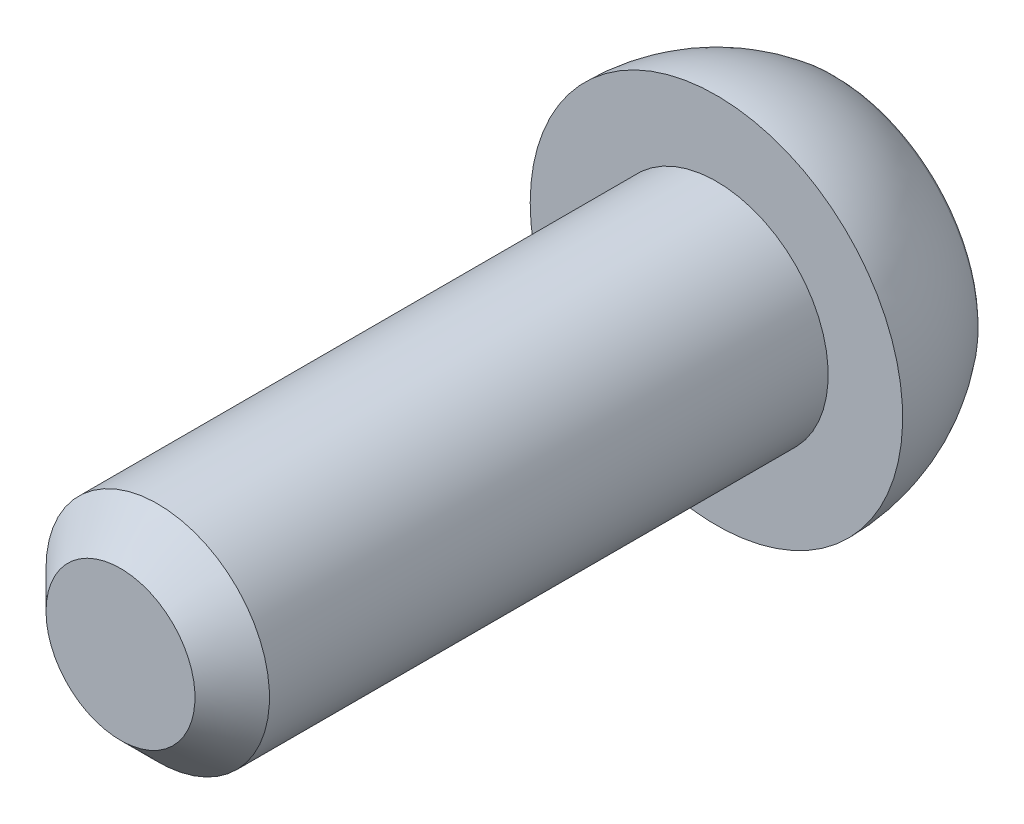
ISO-10303-21;
HEADER;
FILE_DESCRIPTION(('STEP AP214'),'2;1');
FILE_NAME('part.step','',(''),(''),'','','');
FILE_SCHEMA(('AUTOMOTIVE_DESIGN { 1 0 10303 214 1 1 1 1 }'));
ENDSEC;
DATA;
#1=APPLICATION_CONTEXT('core data for automotive mechanical design processes');
#2=APPLICATION_PROTOCOL_DEFINITION('international standard','automotive_design',2000,#1);
#3=PRODUCT_CONTEXT('',#1,'mechanical');
#4=PRODUCT('Part','Part','',(#3));
#5=PRODUCT_RELATED_PRODUCT_CATEGORY('part','',(#4));
#6=PRODUCT_DEFINITION_FORMATION('','',#4);
#7=PRODUCT_DEFINITION_CONTEXT('part definition',#1,'design');
#8=PRODUCT_DEFINITION('design','',#6,#7);
#9=PRODUCT_DEFINITION_SHAPE('','',#8);
#10=(LENGTH_UNIT() NAMED_UNIT(*) SI_UNIT(.MILLI.,.METRE.));
#11=(NAMED_UNIT(*) PLANE_ANGLE_UNIT() SI_UNIT($,.RADIAN.));
#12=(NAMED_UNIT(*) SI_UNIT($,.STERADIAN.) SOLID_ANGLE_UNIT());
#13=UNCERTAINTY_MEASURE_WITH_UNIT(LENGTH_MEASURE(1.E-05),#10,'distance_accuracy_value','');
#14=(GEOMETRIC_REPRESENTATION_CONTEXT(3) GLOBAL_UNCERTAINTY_ASSIGNED_CONTEXT((#13)) GLOBAL_UNIT_ASSIGNED_CONTEXT((#10,
#11,#12)) REPRESENTATION_CONTEXT('',''));
#15=CARTESIAN_POINT('',(0.,0.,0.));
#16=DIRECTION('',(0.,0.,1.));
#17=DIRECTION('',(1.,0.,0.));
#18=AXIS2_PLACEMENT_3D('',#15,#16,#17);
#19=CARTESIAN_POINT('',(-61.38757334,257.949401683,-7.00000000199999));
#20=DIRECTION('',(0.,0.,-0.999999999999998));
#21=DIRECTION('',(0.990350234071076,0.138587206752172,0.));
#22=AXIS2_PLACEMENT_3D('',#19,#20,#21);
#23=PLANE('',#22);
#24=CARTESIAN_POINT('',(-59.1026039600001,256.225433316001,-7.00000000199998));
#25=DIRECTION('',(0.,0.,-0.999999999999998));
#26=DIRECTION('',(-1.,0.,0.));
#27=AXIS2_PLACEMENT_3D('',#24,#25,#26);
#28=CIRCLE('',#27,2.00000000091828);
#29=CARTESIAN_POINT('',(-61.1026039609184,256.225433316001,-7.00000000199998));
#30=VERTEX_POINT('',#29);
#31=EDGE_CURVE('E17',#30,#30,#28,.F.);
#32=ORIENTED_EDGE('',*,*,#31,.T.);
#33=EDGE_LOOP('',(#32));
#34=FACE_BOUND('',#33,.T.);
#35=ADVANCED_FACE('F12',(#34),#23,.F.);
#36=CARTESIAN_POINT('',(-59.1026039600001,256.225433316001,-7.00000000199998));
#37=DIRECTION('',(0.,0.,-0.999999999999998));
#38=DIRECTION('',(-1.,0.,0.));
#39=AXIS2_PLACEMENT_3D('',#36,#37,#38);
#40=CONICAL_SURFACE('',#39,2.00000000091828,0.785398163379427);
#41=CARTESIAN_POINT('',(-59.1026039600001,256.225433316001,-8.000000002));
#42=DIRECTION('',(0.,0.,-0.999999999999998));
#43=DIRECTION('',(0.990350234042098,0.138587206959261,0.));
#44=AXIS2_PLACEMENT_3D('',#41,#42,#43);
#45=CIRCLE('',#44,3.00000000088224);
#46=CARTESIAN_POINT('',(-62.1026039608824,256.225433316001,-8.000000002));
#47=VERTEX_POINT('',#46);
#48=EDGE_CURVE('E95',#47,#47,#45,.F.);
#49=CARTESIAN_POINT('',(-62.1026039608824,256.225433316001,-8.000000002));
#50=CARTESIAN_POINT('',(-62.0921872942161,256.225433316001,-7.98958333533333));
#51=CARTESIAN_POINT('',(-62.0817706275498,256.225433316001,-7.97916666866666));
#52=CARTESIAN_POINT('',(-62.0609372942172,256.225433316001,-7.95833333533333));
#53=CARTESIAN_POINT('',(-62.0505206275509,256.225433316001,-7.94791666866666));
#54=CARTESIAN_POINT('',(-62.0296872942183,256.225433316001,-7.92708333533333));
#55=CARTESIAN_POINT('',(-62.019270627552,256.225433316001,-7.91666666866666));
#56=CARTESIAN_POINT('',(-61.9984372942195,256.225433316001,-7.89583333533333));
#57=CARTESIAN_POINT('',(-61.9880206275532,256.225433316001,-7.88541666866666));
#58=CARTESIAN_POINT('',(-61.9671872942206,256.225433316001,-7.86458333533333));
#59=CARTESIAN_POINT('',(-61.9567706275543,256.225433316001,-7.85416666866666));
#60=CARTESIAN_POINT('',(-61.9359372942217,256.225433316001,-7.83333333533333));
#61=CARTESIAN_POINT('',(-61.9255206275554,256.225433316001,-7.82291666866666));
#62=CARTESIAN_POINT('',(-61.9046872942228,256.225433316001,-7.80208333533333));
#63=CARTESIAN_POINT('',(-61.8942706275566,256.225433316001,-7.79166666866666));
#64=CARTESIAN_POINT('',(-61.873437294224,256.225433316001,-7.77083333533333));
#65=CARTESIAN_POINT('',(-61.8630206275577,256.225433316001,-7.76041666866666));
#66=CARTESIAN_POINT('',(-61.8421872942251,256.225433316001,-7.73958333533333));
#67=CARTESIAN_POINT('',(-61.8317706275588,256.225433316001,-7.72916666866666));
#68=CARTESIAN_POINT('',(-61.8109372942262,256.225433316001,-7.70833333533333));
#69=CARTESIAN_POINT('',(-61.8005206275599,256.225433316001,-7.69791666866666));
#70=CARTESIAN_POINT('',(-61.7796872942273,256.225433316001,-7.67708333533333));
#71=CARTESIAN_POINT('',(-61.7692706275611,256.225433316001,-7.66666666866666));
#72=CARTESIAN_POINT('',(-61.7484372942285,256.225433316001,-7.64583333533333));
#73=CARTESIAN_POINT('',(-61.7380206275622,256.225433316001,-7.63541666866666));
#74=CARTESIAN_POINT('',(-61.7171872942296,256.225433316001,-7.61458333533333));
#75=CARTESIAN_POINT('',(-61.7067706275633,256.225433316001,-7.60416666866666));
#76=CARTESIAN_POINT('',(-61.6859372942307,256.225433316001,-7.58333333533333));
#77=CARTESIAN_POINT('',(-61.6755206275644,256.225433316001,-7.57291666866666));
#78=CARTESIAN_POINT('',(-61.6546872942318,256.225433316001,-7.55208333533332));
#79=CARTESIAN_POINT('',(-61.6442706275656,256.225433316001,-7.54166666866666));
#80=CARTESIAN_POINT('',(-61.623437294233,256.225433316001,-7.52083333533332));
#81=CARTESIAN_POINT('',(-61.6130206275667,256.225433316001,-7.51041666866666));
#82=CARTESIAN_POINT('',(-61.5921872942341,256.225433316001,-7.48958333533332));
#83=CARTESIAN_POINT('',(-61.5817706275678,256.225433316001,-7.47916666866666));
#84=CARTESIAN_POINT('',(-61.5609372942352,256.225433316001,-7.45833333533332));
#85=CARTESIAN_POINT('',(-61.5505206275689,256.225433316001,-7.44791666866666));
#86=CARTESIAN_POINT('',(-61.5296872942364,256.225433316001,-7.42708333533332));
#87=CARTESIAN_POINT('',(-61.5192706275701,256.225433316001,-7.41666666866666));
#88=CARTESIAN_POINT('',(-61.4984372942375,256.225433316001,-7.39583333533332));
#89=CARTESIAN_POINT('',(-61.4880206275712,256.225433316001,-7.38541666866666));
#90=CARTESIAN_POINT('',(-61.4671872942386,256.225433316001,-7.36458333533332));
#91=CARTESIAN_POINT('',(-61.4567706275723,256.225433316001,-7.35416666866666));
#92=CARTESIAN_POINT('',(-61.4359372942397,256.225433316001,-7.33333333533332));
#93=CARTESIAN_POINT('',(-61.4255206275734,256.225433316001,-7.32291666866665));
#94=CARTESIAN_POINT('',(-61.4046872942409,256.225433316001,-7.30208333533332));
#95=CARTESIAN_POINT('',(-61.3942706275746,256.225433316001,-7.29166666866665));
#96=CARTESIAN_POINT('',(-61.373437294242,256.225433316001,-7.27083333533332));
#97=CARTESIAN_POINT('',(-61.3630206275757,256.225433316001,-7.26041666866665));
#98=CARTESIAN_POINT('',(-61.3421872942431,256.225433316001,-7.23958333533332));
#99=CARTESIAN_POINT('',(-61.3317706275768,256.225433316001,-7.22916666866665));
#100=CARTESIAN_POINT('',(-61.3109372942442,256.225433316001,-7.20833333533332));
#101=CARTESIAN_POINT('',(-61.3005206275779,256.225433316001,-7.19791666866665));
#102=CARTESIAN_POINT('',(-61.2796872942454,256.225433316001,-7.17708333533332));
#103=CARTESIAN_POINT('',(-61.2692706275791,256.225433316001,-7.16666666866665));
#104=CARTESIAN_POINT('',(-61.2484372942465,256.225433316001,-7.14583333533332));
#105=CARTESIAN_POINT('',(-61.2380206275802,256.225433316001,-7.13541666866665));
#106=CARTESIAN_POINT('',(-61.2171872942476,256.225433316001,-7.11458333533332));
#107=CARTESIAN_POINT('',(-61.2067706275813,256.225433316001,-7.10416666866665));
#108=CARTESIAN_POINT('',(-61.1859372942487,256.225433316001,-7.08333333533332));
#109=CARTESIAN_POINT('',(-61.1755206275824,256.225433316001,-7.07291666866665));
#110=CARTESIAN_POINT('',(-61.1546872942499,256.225433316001,-7.05208333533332));
#111=CARTESIAN_POINT('',(-61.1442706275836,256.225433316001,-7.04166666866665));
#112=CARTESIAN_POINT('',(-61.123437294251,256.225433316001,-7.02083333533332));
#113=CARTESIAN_POINT('',(-61.1130206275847,256.225433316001,-7.01041666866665));
#114=CARTESIAN_POINT('',(-61.1026039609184,256.225433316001,-7.00000000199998));
#115=B_SPLINE_CURVE_WITH_KNOTS('',3,(#49,#50,#51,#52,#53,#54,#55,#56,#57,#58,#59,#60,#61,#62,
#63,#64,#65,#66,#67,#68,#69,#70,#71,#72,#73,#74,#75,#76,#77,#78,#79,#80,#81,#82,#83,#84,#85,#86,
#87,#88,#89,#90,#91,#92,#93,#94,#95,#96,#97,#98,#99,#100,#101,#102,#103,#104,#105,#106,#107,
#108,#109,#110,#111,#112,#113,#114),.UNSPECIFIED.,.F.,.F.,(4,2,2,2,2,2,2,2,2,2,2,2,2,2,2,2,2,2,
2,2,2,2,2,2,2,2,2,2,2,2,2,2,4),(0.,0.0441941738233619,0.0883883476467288,0.132582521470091,
0.176776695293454,0.220970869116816,0.265165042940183,0.309359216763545,0.353553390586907,
0.397747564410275,0.441941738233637,0.486135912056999,0.530330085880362,0.574524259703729,
0.618718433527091,0.662912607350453,0.707106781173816,0.751300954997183,0.795495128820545,
0.839689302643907,0.883883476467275,0.928077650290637,0.972271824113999,1.01646599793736,
1.06066017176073,1.10485434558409,1.14904851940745,1.19324269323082,1.23743686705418,
1.28163104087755,1.32582521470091,1.37001938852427,1.41421356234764),.UNSPECIFIED.);
#116=EDGE_CURVE('BSEAM262',#47,#30,#115,.T.);
#117=ORIENTED_EDGE('',*,*,#48,.T.);
#118=ORIENTED_EDGE('',*,*,#31,.F.);
#119=ORIENTED_EDGE('',*,*,#116,.T.);
#120=ORIENTED_EDGE('',*,*,#116,.F.);
#121=EDGE_LOOP('',(#117,#119,#118,#120));
#122=FACE_BOUND('',#121,.T.);
#123=ADVANCED_FACE('F262',(#122),#40,.T.);
#124=CARTESIAN_POINT('',(-62.1361919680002,258.189999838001,-24.0000000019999));
#125=DIRECTION('',(0.,0.,-0.999999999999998));
#126=DIRECTION('',(0.99035023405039,0.138587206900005,0.));
#127=AXIS2_PLACEMENT_3D('',#124,#125,#126);
#128=PLANE('',#127);
#129=DIRECTION('',(0.3751550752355,0.926962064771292,0.));
#130=VECTOR('',#129,1.);
#131=CARTESIAN_POINT('',(-61.2958197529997,257.113059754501,-24.0000000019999));
#132=LINE('',#131,#130);
#133=CARTESIAN_POINT('',(-61.8082911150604,255.846806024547,-24.0000000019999));
#134=VERTEX_POINT('',#133);
#135=CARTESIAN_POINT('',(-60.7833483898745,258.379313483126,-24.0000000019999));
#136=VERTEX_POINT('',#135);
#137=EDGE_CURVE('E107',#134,#136,#132,.T.);
#138=ORIENTED_EDGE('',*,*,#137,.T.);
#139=DIRECTION('',(0.990350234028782,0.13858720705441,0.));
#140=VECTOR('',#139,1.);
#141=CARTESIAN_POINT('',(-59.4305048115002,258.568627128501,-24.0000000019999));
#142=LINE('',#141,#140);
#143=CARTESIAN_POINT('',(-58.0776612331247,258.757940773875,-24.0000000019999));
#144=VERTEX_POINT('',#143);
#145=EDGE_CURVE('E86',#136,#144,#142,.T.);
#146=ORIENTED_EDGE('',*,*,#145,.T.);
#147=DIRECTION('',(0.615195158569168,-0.788374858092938,0.));
#148=VECTOR('',#147,1.);
#149=CARTESIAN_POINT('',(-57.2372890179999,257.681000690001,-24.0000000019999));
#150=LINE('',#149,#148);
#151=CARTESIAN_POINT('',(-56.3969168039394,256.604060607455,-24.0000000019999));
#152=VERTEX_POINT('',#151);
#153=EDGE_CURVE('E81',#144,#152,#150,.T.);
#154=ORIENTED_EDGE('',*,*,#153,.T.);
#155=DIRECTION('',(-0.375155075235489,-0.926962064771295,0.));
#156=VECTOR('',#155,1.);
#157=CARTESIAN_POINT('',(-56.9093881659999,255.337806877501,-24.0000000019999));
#158=LINE('',#157,#156);
#159=CARTESIAN_POINT('',(-57.4218595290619,254.071553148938,-24.0000000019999));
#160=VERTEX_POINT('',#159);
#161=EDGE_CURVE('E84',#152,#160,#158,.T.);
#162=ORIENTED_EDGE('',*,*,#161,.T.);
#163=DIRECTION('',(-0.990350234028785,-0.13858720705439,0.));
#164=VECTOR('',#163,1.);
#165=CARTESIAN_POINT('',(-58.7747031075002,253.882239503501,-24.0000000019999));
#166=LINE('',#165,#164);
#167=CARTESIAN_POINT('',(-60.1275466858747,253.692925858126,-24.0000000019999));
#168=VERTEX_POINT('',#167);
#169=EDGE_CURVE('E67',#160,#168,#166,.T.);
#170=ORIENTED_EDGE('',*,*,#169,.T.);
#171=DIRECTION('',(-0.615195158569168,0.788374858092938,0.));
#172=VECTOR('',#171,1.);
#173=CARTESIAN_POINT('',(-60.9679189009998,254.769865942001,-24.0000000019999));
#174=LINE('',#173,#172);
#175=EDGE_CURVE('E114',#168,#134,#174,.T.);
#176=ORIENTED_EDGE('',*,*,#175,.T.);
#177=EDGE_LOOP('',(#138,#146,#154,#162,#170,#176));
#178=FACE_BOUND('',#177,.T.);
#179=ADVANCED_FACE('F83',(#178),#128,.T.);
#180=CARTESIAN_POINT('',(-59.1026039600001,256.225433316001,-8.000000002));
#181=DIRECTION('',(0.,0.,-0.999999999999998));
#182=DIRECTION('',(-1.,0.,0.));
#183=AXIS2_PLACEMENT_3D('',#180,#181,#182);
#184=CYLINDRICAL_SURFACE('',#183,3.00000000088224);
#185=CARTESIAN_POINT('',(-59.1026039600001,256.225433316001,-23.000000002));
#186=DIRECTION('',(0.,0.,-0.999999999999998));
#187=DIRECTION('',(-1.,0.,0.));
#188=AXIS2_PLACEMENT_3D('',#185,#186,#187);
#189=CIRCLE('',#188,3.00000000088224);
#190=CARTESIAN_POINT('',(-62.1026039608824,256.225433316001,-23.000000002));
#191=VERTEX_POINT('',#190);
#192=EDGE_CURVE('E127',#191,#191,#189,.F.);
#193=CARTESIAN_POINT('',(-62.1026039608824,256.225433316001,-23.000000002));
#194=CARTESIAN_POINT('',(-62.1026039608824,256.225433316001,-22.843750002));
#195=CARTESIAN_POINT('',(-62.1026039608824,256.225433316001,-22.687500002));
#196=CARTESIAN_POINT('',(-62.1026039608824,256.225433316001,-22.375000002));
#197=CARTESIAN_POINT('',(-62.1026039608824,256.225433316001,-22.218750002));
#198=CARTESIAN_POINT('',(-62.1026039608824,256.225433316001,-21.906250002));
#199=CARTESIAN_POINT('',(-62.1026039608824,256.225433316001,-21.750000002));
#200=CARTESIAN_POINT('',(-62.1026039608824,256.225433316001,-21.437500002));
#201=CARTESIAN_POINT('',(-62.1026039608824,256.225433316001,-21.281250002));
#202=CARTESIAN_POINT('',(-62.1026039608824,256.225433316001,-20.968750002));
#203=CARTESIAN_POINT('',(-62.1026039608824,256.225433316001,-20.812500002));
#204=CARTESIAN_POINT('',(-62.1026039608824,256.225433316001,-20.500000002));
#205=CARTESIAN_POINT('',(-62.1026039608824,256.225433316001,-20.343750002));
#206=CARTESIAN_POINT('',(-62.1026039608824,256.225433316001,-20.031250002));
#207=CARTESIAN_POINT('',(-62.1026039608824,256.225433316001,-19.875000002));
#208=CARTESIAN_POINT('',(-62.1026039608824,256.225433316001,-19.562500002));
#209=CARTESIAN_POINT('',(-62.1026039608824,256.225433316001,-19.406250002));
#210=CARTESIAN_POINT('',(-62.1026039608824,256.225433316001,-19.093750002));
#211=CARTESIAN_POINT('',(-62.1026039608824,256.225433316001,-18.937500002));
#212=CARTESIAN_POINT('',(-62.1026039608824,256.225433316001,-18.625000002));
#213=CARTESIAN_POINT('',(-62.1026039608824,256.225433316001,-18.468750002));
#214=CARTESIAN_POINT('',(-62.1026039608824,256.225433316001,-18.156250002));
#215=CARTESIAN_POINT('',(-62.1026039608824,256.225433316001,-18.000000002));
#216=CARTESIAN_POINT('',(-62.1026039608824,256.225433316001,-17.687500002));
#217=CARTESIAN_POINT('',(-62.1026039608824,256.225433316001,-17.531250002));
#218=CARTESIAN_POINT('',(-62.1026039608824,256.225433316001,-17.218750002));
#219=CARTESIAN_POINT('',(-62.1026039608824,256.225433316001,-17.062500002));
#220=CARTESIAN_POINT('',(-62.1026039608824,256.225433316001,-16.750000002));
#221=CARTESIAN_POINT('',(-62.1026039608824,256.225433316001,-16.593750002));
#222=CARTESIAN_POINT('',(-62.1026039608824,256.225433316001,-16.281250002));
#223=CARTESIAN_POINT('',(-62.1026039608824,256.225433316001,-16.125000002));
#224=CARTESIAN_POINT('',(-62.1026039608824,256.225433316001,-15.812500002));
#225=CARTESIAN_POINT('',(-62.1026039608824,256.225433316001,-15.656250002));
#226=CARTESIAN_POINT('',(-62.1026039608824,256.225433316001,-15.343750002));
#227=CARTESIAN_POINT('',(-62.1026039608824,256.225433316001,-15.187500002));
#228=CARTESIAN_POINT('',(-62.1026039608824,256.225433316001,-14.875000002));
#229=CARTESIAN_POINT('',(-62.1026039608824,256.225433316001,-14.718750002));
#230=CARTESIAN_POINT('',(-62.1026039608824,256.225433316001,-14.406250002));
#231=CARTESIAN_POINT('',(-62.1026039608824,256.225433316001,-14.250000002));
#232=CARTESIAN_POINT('',(-62.1026039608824,256.225433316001,-13.937500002));
#233=CARTESIAN_POINT('',(-62.1026039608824,256.225433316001,-13.781250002));
#234=CARTESIAN_POINT('',(-62.1026039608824,256.225433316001,-13.468750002));
#235=CARTESIAN_POINT('',(-62.1026039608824,256.225433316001,-13.312500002));
#236=CARTESIAN_POINT('',(-62.1026039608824,256.225433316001,-13.000000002));
#237=CARTESIAN_POINT('',(-62.1026039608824,256.225433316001,-12.843750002));
#238=CARTESIAN_POINT('',(-62.1026039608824,256.225433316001,-12.531250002));
#239=CARTESIAN_POINT('',(-62.1026039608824,256.225433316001,-12.375000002));
#240=CARTESIAN_POINT('',(-62.1026039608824,256.225433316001,-12.062500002));
#241=CARTESIAN_POINT('',(-62.1026039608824,256.225433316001,-11.906250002));
#242=CARTESIAN_POINT('',(-62.1026039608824,256.225433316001,-11.593750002));
#243=CARTESIAN_POINT('',(-62.1026039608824,256.225433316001,-11.437500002));
#244=CARTESIAN_POINT('',(-62.1026039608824,256.225433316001,-11.125000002));
#245=CARTESIAN_POINT('',(-62.1026039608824,256.225433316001,-10.968750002));
#246=CARTESIAN_POINT('',(-62.1026039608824,256.225433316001,-10.656250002));
#247=CARTESIAN_POINT('',(-62.1026039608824,256.225433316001,-10.500000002));
#248=CARTESIAN_POINT('',(-62.1026039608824,256.225433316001,-10.187500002));
#249=CARTESIAN_POINT('',(-62.1026039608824,256.225433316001,-10.031250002));
#250=CARTESIAN_POINT('',(-62.1026039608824,256.225433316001,-9.71875000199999));
#251=CARTESIAN_POINT('',(-62.1026039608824,256.225433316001,-9.56250000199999));
#252=CARTESIAN_POINT('',(-62.1026039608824,256.225433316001,-9.25000000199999));
#253=CARTESIAN_POINT('',(-62.1026039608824,256.225433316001,-9.09375000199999));
#254=CARTESIAN_POINT('',(-62.1026039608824,256.225433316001,-8.781250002));
#255=CARTESIAN_POINT('',(-62.1026039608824,256.225433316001,-8.625000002));
#256=CARTESIAN_POINT('',(-62.1026039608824,256.225433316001,-8.312500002));
#257=CARTESIAN_POINT('',(-62.1026039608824,256.225433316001,-8.156250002));
#258=CARTESIAN_POINT('',(-62.1026039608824,256.225433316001,-8.000000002));
#259=B_SPLINE_CURVE_WITH_KNOTS('',3,(#193,#194,#195,#196,#197,#198,#199,#200,#201,#202,#203,
#204,#205,#206,#207,#208,#209,#210,#211,#212,#213,#214,#215,#216,#217,#218,#219,#220,#221,#222,
#223,#224,#225,#226,#227,#228,#229,#230,#231,#232,#233,#234,#235,#236,#237,#238,#239,#240,#241,
#242,#243,#244,#245,#246,#247,#248,#249,#250,#251,#252,#253,#254,#255,#256,#257,#258),
.UNSPECIFIED.,.F.,.F.,(4,2,2,2,2,2,2,2,2,2,2,2,2,2,2,2,2,2,2,2,2,2,2,2,2,2,2,2,2,2,2,2,4),(0.,
0.46875,0.937499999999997,1.40624999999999,1.87499999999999,2.34375,2.81249999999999,
3.28124999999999,3.74999999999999,4.21874999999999,4.68749999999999,5.15624999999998,
5.62499999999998,6.09374999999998,6.56249999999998,7.03124999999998,7.49999999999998,
7.96874999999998,8.43749999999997,8.90624999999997,9.37499999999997,9.84374999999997,10.3125,
10.78125,11.25,11.71875,12.1875,12.65625,13.125,13.59375,14.0625,14.53125,15.),.UNSPECIFIED.);
#260=EDGE_CURVE('BSEAM260',#191,#47,#259,.T.);
#261=ORIENTED_EDGE('',*,*,#192,.T.);
#262=ORIENTED_EDGE('',*,*,#48,.F.);
#263=ORIENTED_EDGE('',*,*,#260,.T.);
#264=ORIENTED_EDGE('',*,*,#260,.F.);
#265=EDGE_LOOP('',(#261,#263,#262,#264));
#266=FACE_BOUND('',#265,.T.);
#267=ADVANCED_FACE('F260',(#266),#184,.T.);
#268=CARTESIAN_POINT('',(-57.4218595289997,254.071553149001,-26.3000000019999));
#269=DIRECTION('',(0.926962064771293,-0.375155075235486,0.));
#270=DIRECTION('',(0.375155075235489,0.926962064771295,0.));
#271=AXIS2_PLACEMENT_3D('',#268,#269,#270);
#272=PLANE('',#271);
#273=DIRECTION('',(0.,0.,0.999999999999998));
#274=VECTOR('',#273,1.);
#275=CARTESIAN_POINT('',(-57.4218595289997,254.071553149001,-25.1500000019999));
#276=LINE('',#275,#274);
#277=CARTESIAN_POINT('',(-57.4218595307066,254.071553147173,-26.3000000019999));
#278=VERTEX_POINT('',#277);
#279=EDGE_CURVE('E94',#278,#160,#276,.T.);
#280=ORIENTED_EDGE('',*,*,#279,.T.);
#281=ORIENTED_EDGE('',*,*,#161,.F.);
#282=DIRECTION('',(0.,0.,-0.999999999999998));
#283=VECTOR('',#282,1.);
#284=CARTESIAN_POINT('',(-56.396916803,256.604060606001,-25.1500000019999));
#285=LINE('',#284,#283);
#286=CARTESIAN_POINT('',(-56.3969168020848,256.604060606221,-26.3000000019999));
#287=VERTEX_POINT('',#286);
#288=EDGE_CURVE('E90',#152,#287,#285,.T.);
#289=ORIENTED_EDGE('',*,*,#288,.T.);
#290=DIRECTION('',(0.37515507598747,0.926962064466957,0.));
#291=VECTOR('',#290,1.);
#292=CARTESIAN_POINT('',(-57.4218595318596,254.07155314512,-26.3000000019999));
#293=LINE('',#292,#291);
#294=EDGE_CURVE('E58',#278,#287,#293,.T.);
#295=ORIENTED_EDGE('',*,*,#294,.F.);
#296=EDGE_LOOP('',(#280,#281,#289,#295));
#297=FACE_BOUND('',#296,.T.);
#298=ADVANCED_FACE('F92',(#297),#272,.F.);
#299=CARTESIAN_POINT('',(-56.396916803,256.604060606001,-26.3000000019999));
#300=DIRECTION('',(0.788374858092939,0.615195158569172,0.));
#301=DIRECTION('',(-0.615195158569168,0.788374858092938,0.));
#302=AXIS2_PLACEMENT_3D('',#299,#300,#301);
#303=PLANE('',#302);
#304=ORIENTED_EDGE('',*,*,#288,.F.);
#305=ORIENTED_EDGE('',*,*,#153,.F.);
#306=DIRECTION('',(0.,0.,-0.999999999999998));
#307=VECTOR('',#306,1.);
#308=CARTESIAN_POINT('',(-58.0776612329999,258.757940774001,-25.1500000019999));
#309=LINE('',#308,#307);
#310=CARTESIAN_POINT('',(-58.077661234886,258.757940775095,-26.3000000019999));
#311=VERTEX_POINT('',#310);
#312=EDGE_CURVE('E101',#144,#311,#309,.T.);
#313=ORIENTED_EDGE('',*,*,#312,.T.);
#314=DIRECTION('',(-0.615195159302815,0.788374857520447,0.));
#315=VECTOR('',#314,1.);
#316=CARTESIAN_POINT('',(-56.3969168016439,256.604060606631,-26.3000000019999));
#317=LINE('',#316,#315);
#318=EDGE_CURVE('E99',#287,#311,#317,.T.);
#319=ORIENTED_EDGE('',*,*,#318,.F.);
#320=EDGE_LOOP('',(#304,#305,#313,#319));
#321=FACE_BOUND('',#320,.T.);
#322=ADVANCED_FACE('F97',(#321),#303,.F.);
#323=CARTESIAN_POINT('',(-58.0776612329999,258.757940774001,-24.0000000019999));
#324=DIRECTION('',(-0.138587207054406,0.990350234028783,0.));
#325=DIRECTION('',(0.,0.,-0.999999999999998));
#326=AXIS2_PLACEMENT_3D('',#323,#324,#325);
#327=PLANE('',#326);
#328=ORIENTED_EDGE('',*,*,#312,.F.);
#329=ORIENTED_EDGE('',*,*,#145,.F.);
#330=DIRECTION('',(0.,0.,-0.999999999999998));
#331=VECTOR('',#330,1.);
#332=CARTESIAN_POINT('',(-60.7833483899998,258.379313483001,-25.1500000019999));
#333=LINE('',#332,#331);
#334=CARTESIAN_POINT('',(-60.7833483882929,258.379313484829,-26.3000000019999));
#335=VERTEX_POINT('',#334);
#336=EDGE_CURVE('E112',#136,#335,#333,.T.);
#337=ORIENTED_EDGE('',*,*,#336,.T.);
#338=DIRECTION('',(-0.990350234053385,-0.138587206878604,0.));
#339=VECTOR('',#338,1.);
#340=CARTESIAN_POINT('',(-59.4305048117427,258.568627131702,-26.3000000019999));
#341=LINE('',#340,#339);
#342=EDGE_CURVE('E108',#311,#335,#341,.T.);
#343=ORIENTED_EDGE('',*,*,#342,.F.);
#344=EDGE_LOOP('',(#328,#329,#337,#343));
#345=FACE_BOUND('',#344,.T.);
#346=ADVANCED_FACE('F252',(#345),#327,.F.);
#347=CARTESIAN_POINT('',(-60.7833483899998,258.379313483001,-26.3000000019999));
#348=DIRECTION('',(-0.926962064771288,0.375155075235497,0.));
#349=DIRECTION('',(-0.3751550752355,-0.926962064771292,0.));
#350=AXIS2_PLACEMENT_3D('',#347,#348,#349);
#351=PLANE('',#350);
#352=ORIENTED_EDGE('',*,*,#336,.F.);
#353=ORIENTED_EDGE('',*,*,#137,.F.);
#354=DIRECTION('',(0.,0.,-0.999999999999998));
#355=VECTOR('',#354,1.);
#356=CARTESIAN_POINT('',(-61.8082911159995,255.846806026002,-25.1500000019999));
#357=LINE('',#356,#355);
#358=CARTESIAN_POINT('',(-61.8082911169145,255.846806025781,-26.3000000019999));
#359=VERTEX_POINT('',#358);
#360=EDGE_CURVE('E181',#134,#359,#357,.T.);
#361=ORIENTED_EDGE('',*,*,#360,.T.);
#362=DIRECTION('',(-0.375155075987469,-0.926962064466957,0.));
#363=VECTOR('',#362,1.);
#364=CARTESIAN_POINT('',(-60.7833483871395,258.379313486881,-26.3000000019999));
#365=LINE('',#364,#363);
#366=EDGE_CURVE('E111',#335,#359,#365,.T.);
#367=ORIENTED_EDGE('',*,*,#366,.F.);
#368=EDGE_LOOP('',(#352,#353,#361,#367));
#369=FACE_BOUND('',#368,.T.);
#370=ADVANCED_FACE('F246',(#369),#351,.F.);
#371=CARTESIAN_POINT('',(-61.8082911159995,255.846806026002,-26.3000000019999));
#372=DIRECTION('',(-0.788374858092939,-0.615195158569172,0.));
#373=DIRECTION('',(0.615195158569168,-0.788374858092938,0.));
#374=AXIS2_PLACEMENT_3D('',#371,#372,#373);
#375=PLANE('',#374);
#376=ORIENTED_EDGE('',*,*,#360,.F.);
#377=ORIENTED_EDGE('',*,*,#175,.F.);
#378=DIRECTION('',(0.,0.,-0.999999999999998));
#379=VECTOR('',#378,1.);
#380=CARTESIAN_POINT('',(-60.1275466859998,253.692925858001,-25.1500000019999));
#381=LINE('',#380,#379);
#382=CARTESIAN_POINT('',(-60.1275466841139,253.692925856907,-26.3000000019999));
#383=VERTEX_POINT('',#382);
#384=EDGE_CURVE('E139',#168,#383,#381,.T.);
#385=ORIENTED_EDGE('',*,*,#384,.T.);
#386=DIRECTION('',(0.615195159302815,-0.788374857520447,0.));
#387=VECTOR('',#386,1.);
#388=CARTESIAN_POINT('',(-61.8082911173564,255.84680602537,-26.3000000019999));
#389=LINE('',#388,#387);
#390=EDGE_CURVE('E119',#359,#383,#389,.T.);
#391=ORIENTED_EDGE('',*,*,#390,.F.);
#392=EDGE_LOOP('',(#376,#377,#385,#391));
#393=FACE_BOUND('',#392,.T.);
#394=ADVANCED_FACE('F242',(#393),#375,.F.);
#395=CARTESIAN_POINT('',(-57.4218595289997,254.071553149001,-26.3000000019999));
#396=DIRECTION('',(0.138587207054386,-0.990350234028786,0.));
#397=DIRECTION('',(0.,0.,0.999999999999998));
#398=AXIS2_PLACEMENT_3D('',#395,#396,#397);
#399=PLANE('',#398);
#400=ORIENTED_EDGE('',*,*,#384,.F.);
#401=ORIENTED_EDGE('',*,*,#169,.F.);
#402=ORIENTED_EDGE('',*,*,#279,.F.);
#403=DIRECTION('',(0.990350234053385,0.138587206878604,0.));
#404=VECTOR('',#403,1.);
#405=CARTESIAN_POINT('',(-58.7747031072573,253.8822395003,-26.3000000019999));
#406=LINE('',#405,#404);
#407=EDGE_CURVE('E122',#383,#278,#406,.T.);
#408=ORIENTED_EDGE('',*,*,#407,.F.);
#409=EDGE_LOOP('',(#400,#401,#402,#408));
#410=FACE_BOUND('',#409,.T.);
#411=ADVANCED_FACE('F194',(#410),#399,.F.);
#412=CARTESIAN_POINT('',(-59.5908166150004,259.714222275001,-26.300000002));
#413=CARTESIAN_POINT('',(-52.6132386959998,260.690647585,-26.300000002));
#414=CARTESIAN_POINT('',(-51.6368133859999,253.713069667,-26.300000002));
#415=CARTESIAN_POINT('',(-58.614391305,252.736644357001,-26.3000000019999));
#416=CARTESIAN_POINT('',(-59.612318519,259.867875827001,-26.3000000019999));
#417=CARTESIAN_POINT('',(-52.3274334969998,260.887304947,-26.3000000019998));
#418=CARTESIAN_POINT('',(-51.3080043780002,253.602419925,-26.3000000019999));
#419=CARTESIAN_POINT('',(-58.5928894,252.582990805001,-26.3000000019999));
#420=CARTESIAN_POINT('',(-59.6316835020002,260.006258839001,-26.2325694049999));
#421=CARTESIAN_POINT('',(-52.0700324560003,261.064417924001,-26.2325694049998));
#422=CARTESIAN_POINT('',(-51.0118733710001,253.502766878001,-26.2325694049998));
#423=CARTESIAN_POINT('',(-58.5735244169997,252.444607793,-26.2325694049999));
#424=CARTESIAN_POINT('',(-59.645062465,260.101865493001,-26.111111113));
#425=CARTESIAN_POINT('',(-51.8921981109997,261.186782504,-26.111111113));
#426=CARTESIAN_POINT('',(-50.8072811,253.433918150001,-26.111111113));
#427=CARTESIAN_POINT('',(-58.5601454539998,252.349001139,-26.1111111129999));
#428=(BOUNDED_SURFACE() B_SPLINE_SURFACE(3,3,((#412,#413,#414,#415),(#416,#417,#418,#419),(#420,
#421,#422,#423),(#424,#425,#426,#427)),.UNSPECIFIED.,.F.,.F.,
.F.) B_SPLINE_SURFACE_WITH_KNOTS((4,4),(4,4),(0.,1.),(0.,1.),
.UNSPECIFIED.) GEOMETRIC_REPRESENTATION_ITEM() RATIONAL_B_SPLINE_SURFACE(((1.,0.333333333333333,
0.333333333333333,1.),(0.933744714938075,0.311248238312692,0.311248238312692,0.933744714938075),
(0.933744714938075,0.311248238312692,0.311248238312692,0.933744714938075),(1.,0.333333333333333,
0.333333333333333,1.))) REPRESENTATION_ITEM('') SURFACE());
#429=CARTESIAN_POINT('',(-58.614391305,252.736644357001,-26.3000000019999));
#430=CARTESIAN_POINT('',(-58.5928894,252.582990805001,-26.3000000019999));
#431=CARTESIAN_POINT('',(-58.5735244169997,252.444607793,-26.2325694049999));
#432=CARTESIAN_POINT('',(-58.5601454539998,252.349001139,-26.1111111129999));
#433=(BOUNDED_CURVE() B_SPLINE_CURVE(3,(#429,#430,#431,#432),.UNSPECIFIED.,.F.,
.F.) B_SPLINE_CURVE_WITH_KNOTS((4,4),(0.,1.),
.UNSPECIFIED.) CURVE() GEOMETRIC_REPRESENTATION_ITEM() RATIONAL_B_SPLINE_CURVE((1.,
0.933744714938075,0.933744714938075,1.)) REPRESENTATION_ITEM(''));
#434=CARTESIAN_POINT('',(-58.5601454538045,252.349001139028,-26.1111111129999));
#435=VERTEX_POINT('',#434);
#436=CARTESIAN_POINT('',(-58.614391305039,252.736644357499,-26.3000000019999));
#437=VERTEX_POINT('',#436);
#438=EDGE_CURVE('E129',#435,#437,#433,.F.);
#439=CARTESIAN_POINT('',(-58.614391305,252.736644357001,-26.3000000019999));
#440=CARTESIAN_POINT('',(-51.6368133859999,253.713069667,-26.300000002));
#441=CARTESIAN_POINT('',(-52.6132386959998,260.690647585,-26.300000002));
#442=CARTESIAN_POINT('',(-59.5908166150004,259.714222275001,-26.300000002));
#443=(BOUNDED_CURVE() B_SPLINE_CURVE(3,(#439,#440,#441,#442),.UNSPECIFIED.,.F.,
.F.) B_SPLINE_CURVE_WITH_KNOTS((4,4),(0.,1.),
.UNSPECIFIED.) CURVE() GEOMETRIC_REPRESENTATION_ITEM() RATIONAL_B_SPLINE_CURVE((1.,
0.333333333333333,0.333333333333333,1.)) REPRESENTATION_ITEM(''));
#444=CARTESIAN_POINT('',(-59.5908166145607,259.714222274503,-26.300000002));
#445=VERTEX_POINT('',#444);
#446=EDGE_CURVE('E126',#445,#437,#443,.F.);
#447=CARTESIAN_POINT('',(-59.5908166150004,259.714222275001,-26.300000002));
#448=CARTESIAN_POINT('',(-59.612318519,259.867875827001,-26.3000000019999));
#449=CARTESIAN_POINT('',(-59.6316835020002,260.006258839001,-26.2325694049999));
#450=CARTESIAN_POINT('',(-59.645062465,260.101865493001,-26.111111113));
#451=(BOUNDED_CURVE() B_SPLINE_CURVE(3,(#447,#448,#449,#450),.UNSPECIFIED.,.F.,
.F.) B_SPLINE_CURVE_WITH_KNOTS((4,4),(0.,1.),
.UNSPECIFIED.) CURVE() GEOMETRIC_REPRESENTATION_ITEM() RATIONAL_B_SPLINE_CURVE((1.,
0.933744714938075,0.933744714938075,1.)) REPRESENTATION_ITEM(''));
#452=CARTESIAN_POINT('',(-59.6450624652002,260.101865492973,-26.111111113));
#453=VERTEX_POINT('',#452);
#454=EDGE_CURVE('E133',#445,#453,#451,.T.);
#455=CARTESIAN_POINT('',(-59.1026039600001,256.225433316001,-26.1111110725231));
#456=DIRECTION('',(0.,0.,-0.999999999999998));
#457=DIRECTION('',(-0.990350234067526,-0.138587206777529,0.));
#458=AXIS2_PLACEMENT_3D('',#455,#456,#457);
#459=CIRCLE('',#458,3.91420335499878);
#460=EDGE_CURVE('E118',#453,#435,#459,.T.);
#461=ORIENTED_EDGE('',*,*,#438,.T.);
#462=ORIENTED_EDGE('',*,*,#446,.F.);
#463=ORIENTED_EDGE('',*,*,#454,.T.);
#464=ORIENTED_EDGE('',*,*,#460,.T.);
#465=EDGE_LOOP('',(#461,#462,#463,#464));
#466=FACE_BOUND('',#465,.T.);
#467=ADVANCED_FACE('F208',(#466),#428,.T.);
#468=CARTESIAN_POINT('',(-64.8150274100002,260.535354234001,-23.000000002));
#469=DIRECTION('',(0.,0.,-0.999999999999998));
#470=DIRECTION('',(0.9903502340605,0.138587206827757,0.));
#471=AXIS2_PLACEMENT_3D('',#468,#469,#470);
#472=PLANE('',#471);
#473=ORIENTED_EDGE('',*,*,#192,.F.);
#474=EDGE_LOOP('',(#473));
#475=FACE_BOUND('',#474,.T.);
#476=CARTESIAN_POINT('',(-59.1026039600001,256.225433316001,-23.000000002));
#477=DIRECTION('',(0.,0.,-0.999999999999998));
#478=DIRECTION('',(-1.,0.,0.));
#479=AXIS2_PLACEMENT_3D('',#476,#477,#478);
#480=CIRCLE('',#479,4.99999999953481);
#481=CARTESIAN_POINT('',(-64.1026039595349,256.225433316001,-23.000000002));
#482=VERTEX_POINT('',#481);
#483=EDGE_CURVE('E115',#482,#482,#480,.F.);
#484=ORIENTED_EDGE('',*,*,#483,.T.);
#485=EDGE_LOOP('',(#484));
#486=FACE_BOUND('',#485,.T.);
#487=ADVANCED_FACE('F236',(#475,#486),#472,.F.);
#488=CARTESIAN_POINT('',(-56.0660207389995,260.250158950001,-26.300000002));
#489=DIRECTION('',(0.,0.,-0.999999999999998));
#490=DIRECTION('',(0.13858720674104,-0.990350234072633,0.));
#491=AXIS2_PLACEMENT_3D('',#488,#489,#490);
#492=PLANE('',#491);
#493=ORIENTED_EDGE('',*,*,#390,.T.);
#494=ORIENTED_EDGE('',*,*,#407,.T.);
#495=ORIENTED_EDGE('',*,*,#294,.T.);
#496=ORIENTED_EDGE('',*,*,#318,.T.);
#497=ORIENTED_EDGE('',*,*,#342,.T.);
#498=ORIENTED_EDGE('',*,*,#366,.T.);
#499=EDGE_LOOP('',(#493,#494,#495,#496,#497,#498));
#500=FACE_BOUND('',#499,.T.);
#501=CARTESIAN_POINT('',(-59.5908166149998,259.714222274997,-26.300000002));
#502=CARTESIAN_POINT('',(-59.6277319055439,259.709056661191,-26.300000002));
#503=CARTESIAN_POINT('',(-59.6645651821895,259.703304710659,-26.300000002));
#504=CARTESIAN_POINT('',(-59.739195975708,259.690433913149,-26.300000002));
#505=CARTESIAN_POINT('',(-59.7769870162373,259.683277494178,-26.300000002));
#506=CARTESIAN_POINT('',(-59.853507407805,259.667484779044,-26.300000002));
#507=CARTESIAN_POINT('',(-59.8922285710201,259.658808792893,-26.300000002));
#508=CARTESIAN_POINT('',(-59.9705737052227,259.639859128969,-26.300000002));
#509=CARTESIAN_POINT('',(-60.0101875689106,259.62954364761,-26.300000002));
#510=CARTESIAN_POINT('',(-60.0902717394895,259.607192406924,-26.300000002));
#511=CARTESIAN_POINT('',(-60.1307297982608,259.595112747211,-26.300000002));
#512=CARTESIAN_POINT('',(-60.2124438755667,259.569106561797,-26.300000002));
#513=CARTESIAN_POINT('',(-60.2536852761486,259.555134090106,-26.300000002));
#514=CARTESIAN_POINT('',(-60.3368941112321,259.525212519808,-26.300000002));
#515=CARTESIAN_POINT('',(-60.3788443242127,259.509215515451,-26.300000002));
#516=CARTESIAN_POINT('',(-60.4633840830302,259.475113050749,-26.300000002));
#517=CARTESIAN_POINT('',(-60.5059535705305,259.456957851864,-26.300000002));
#518=CARTESIAN_POINT('',(-60.5916290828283,259.418406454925,-26.300000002));
#519=CARTESIAN_POINT('',(-60.6347119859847,259.397958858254,-26.300000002));
#520=CARTESIAN_POINT('',(-60.7212941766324,259.354691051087,-26.300000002));
#521=CARTESIAN_POINT('',(-60.7647670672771,259.331818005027,-26.300000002));
#522=CARTESIAN_POINT('',(-60.851990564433,259.283570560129,-26.300000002));
#523=CARTESIAN_POINT('',(-60.8957113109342,259.2581421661,-26.300000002));
#524=CARTESIAN_POINT('',(-60.9832723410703,259.204660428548,-26.300000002));
#525=CARTESIAN_POINT('',(-61.0270791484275,259.176552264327,-26.300000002));
#526=CARTESIAN_POINT('',(-61.1146338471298,259.117595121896,-26.300000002));
#527=CARTESIAN_POINT('',(-61.158344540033,259.086690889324,-26.300000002));
#528=CARTESIAN_POINT('',(-61.2455078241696,259.022036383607,-26.300000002));
#529=CARTESIAN_POINT('',(-61.2889194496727,258.98823087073,-26.300000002));
#530=CARTESIAN_POINT('',(-61.3752646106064,258.917682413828,-26.300000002));
#531=CARTESIAN_POINT('',(-61.4181534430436,258.880884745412,-26.300000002));
#532=CARTESIAN_POINT('',(-61.503212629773,258.804277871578,-26.300000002));
#533=CARTESIAN_POINT('',(-61.5453346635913,258.764415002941,-26.300000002));
#534=CARTESIAN_POINT('',(-61.6286004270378,258.681624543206,-26.300000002));
#535=CARTESIAN_POINT('',(-61.6696924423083,258.638644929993,-26.300000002));
#536=CARTESIAN_POINT('',(-61.7506205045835,258.549592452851,-26.300000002));
#537=CARTESIAN_POINT('',(-61.7904017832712,258.503469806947,-26.300000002));
#538=CARTESIAN_POINT('',(-61.8684151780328,258.408131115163,-26.300000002));
#539=CARTESIAN_POINT('',(-61.9065899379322,258.358868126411,-26.300000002));
#540=CARTESIAN_POINT('',(-61.981084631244,258.257280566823,-26.300000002));
#541=CARTESIAN_POINT('',(-62.0173452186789,258.204912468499,-26.300000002));
#542=CARTESIAN_POINT('',(-62.087697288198,258.097181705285,-26.300000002));
#543=CARTESIAN_POINT('',(-62.12172816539,258.041779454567,-26.300000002));
#544=CARTESIAN_POINT('',(-62.1873024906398,257.928085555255,-26.300000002));
#545=CARTESIAN_POINT('',(-62.2187849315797,257.869758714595,-26.300000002));
#546=CARTESIAN_POINT('',(-62.2789455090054,257.750360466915,-26.300000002));
#547=CARTESIAN_POINT('',(-62.3075632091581,257.689258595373,-26.300000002));
#548=CARTESIAN_POINT('',(-62.3616842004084,257.564498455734,-26.300000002));
#549=CARTESIAN_POINT('',(-62.3871286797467,257.500814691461,-26.300000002));
#550=CARTESIAN_POINT('',(-62.4346087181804,257.371113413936,-26.300000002));
#551=CARTESIAN_POINT('',(-62.4565882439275,257.305075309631,-26.300000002));
#552=CARTESIAN_POINT('',(-62.4866944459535,257.204803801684,-26.300000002));
#553=CARTESIAN_POINT('',(-62.4962933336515,257.171005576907,-26.300000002));
#554=CARTESIAN_POINT('',(-62.5145317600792,257.102928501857,-26.300000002));
#555=CARTESIAN_POINT('',(-62.5231650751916,257.068647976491,-26.300000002));
#556=CARTESIAN_POINT('',(-62.539442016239,256.99964767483,-26.300000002));
#557=CARTESIAN_POINT('',(-62.5470797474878,256.964926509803,-26.300000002));
#558=CARTESIAN_POINT('',(-62.5613380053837,256.895086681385,-26.300000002));
#559=CARTESIAN_POINT('',(-62.5679530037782,256.859966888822,-26.300000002));
#560=CARTESIAN_POINT('',(-62.5801404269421,256.789374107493,-26.300000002));
#561=CARTESIAN_POINT('',(-62.5857077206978,256.753900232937,-26.300000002));
#562=CARTESIAN_POINT('',(-62.5957769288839,256.682645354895,-26.300000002));
#563=CARTESIAN_POINT('',(-62.6002741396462,256.646863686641,-26.300000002));
#564=CARTESIAN_POINT('',(-62.608183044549,256.575041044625,-26.300000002));
#565=CARTESIAN_POINT('',(-62.6115904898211,256.538999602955,-26.300000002));
#566=CARTESIAN_POINT('',(-62.6173025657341,256.466706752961,-26.300000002));
#567=CARTESIAN_POINT('',(-62.6196034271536,256.430455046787,-26.300000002));
#568=CARTESIAN_POINT('',(-62.6230880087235,256.357792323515,-26.300000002));
#569=CARTESIAN_POINT('',(-62.6242684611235,256.321381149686,-26.300000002));
#570=CARTESIAN_POINT('',(-62.625500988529,256.248451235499,-26.300000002));
#571=CARTESIAN_POINT('',(-62.6255503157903,256.211932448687,-26.300000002));
#572=CARTESIAN_POINT('',(-62.6245125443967,256.138839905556,-26.300000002));
#573=CARTESIAN_POINT('',(-62.6234232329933,256.102266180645,-26.300000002));
#574=CARTESIAN_POINT('',(-62.6201033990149,256.029116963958,-26.300000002));
#575=CARTESIAN_POINT('',(-62.6178712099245,255.992541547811,-26.300000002));
#576=CARTESIAN_POINT('',(-62.6122641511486,255.919442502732,-26.300000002));
#577=CARTESIAN_POINT('',(-62.6088881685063,255.882918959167,-26.300000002));
#578=CARTESIAN_POINT('',(-62.6009953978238,255.809977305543,-26.300000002));
#579=CARTESIAN_POINT('',(-62.5964780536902,255.773559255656,-26.300000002));
#580=CARTESIAN_POINT('',(-62.5863077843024,255.700882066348,-26.300000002));
#581=CARTESIAN_POINT('',(-62.5806548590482,255.664622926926,-26.300000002));
#582=CARTESIAN_POINT('',(-62.5682219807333,255.592316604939,-26.300000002));
#583=CARTESIAN_POINT('',(-62.5614425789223,255.556269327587,-26.300000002));
#584=CARTESIAN_POINT('',(-62.5467685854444,255.484439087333,-26.300000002));
#585=CARTESIAN_POINT('',(-62.5388750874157,255.448655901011,-26.300000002));
#586=CARTESIAN_POINT('',(-62.5219879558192,255.377405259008,-26.300000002));
#587=CARTESIAN_POINT('',(-62.512995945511,255.34193741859,-26.300000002));
#588=CARTESIAN_POINT('',(-62.4939299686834,255.27136769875,-26.300000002));
#589=CARTESIAN_POINT('',(-62.4838581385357,255.236265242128,-26.300000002));
#590=CARTESIAN_POINT('',(-62.4626537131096,255.166475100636,-26.300000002));
#591=CARTESIAN_POINT('',(-62.451523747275,255.131786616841,-26.300000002));
#592=CARTESIAN_POINT('',(-62.4282271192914,255.062871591,-26.300000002));
#593=CARTESIAN_POINT('',(-62.4160635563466,255.028644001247,-26.300000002));
#594=CARTESIAN_POINT('',(-62.3907265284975,254.960696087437,-26.300000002));
#595=CARTESIAN_POINT('',(-62.3775566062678,254.926974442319,-26.300000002));
#596=CARTESIAN_POINT('',(-62.3502362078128,254.860081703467,-26.300000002));
#597=CARTESIAN_POINT('',(-62.3360896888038,254.826908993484,-26.300000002));
#598=CARTESIAN_POINT('',(-62.3068478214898,254.761155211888,-26.300000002));
#599=CARTESIAN_POINT('',(-62.2917568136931,254.728572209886,-26.300000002));
#600=CARTESIAN_POINT('',(-62.2606598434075,254.664036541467,-26.300000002));
#601=CARTESIAN_POINT('',(-62.2446585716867,254.632081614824,-26.300000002));
#602=CARTESIAN_POINT('',(-62.2117769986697,254.568838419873,-26.300000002));
#603=CARTESIAN_POINT('',(-62.1949017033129,254.537547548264,-26.300000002));
#604=CARTESIAN_POINT('',(-62.1603094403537,254.475665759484,-26.300000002));
#605=CARTESIAN_POINT('',(-62.1425977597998,254.445071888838,-26.300000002));
#606=CARTESIAN_POINT('',(-62.1063727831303,254.384616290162,-26.300000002));
#607=CARTESIAN_POINT('',(-62.0878650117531,254.354751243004,-26.300000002));
#608=CARTESIAN_POINT('',(-62.031390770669,254.26659559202,-26.300000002));
#609=CARTESIAN_POINT('',(-61.9921280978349,254.209127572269,-26.300000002));
#610=CARTESIAN_POINT('',(-61.9108689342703,254.097441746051,-26.300000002));
#611=CARTESIAN_POINT('',(-61.8689206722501,254.043188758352,-26.300000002));
#612=CARTESIAN_POINT('',(-61.782631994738,253.938077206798,-26.300000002));
#613=CARTESIAN_POINT('',(-61.7383411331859,253.887177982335,-26.300000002));
#614=CARTESIAN_POINT('',(-61.6477167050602,253.788880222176,-26.300000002));
#615=CARTESIAN_POINT('',(-61.6014328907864,253.74143580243,-26.300000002));
#616=CARTESIAN_POINT('',(-61.5071685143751,253.650109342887,-26.300000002));
#617=CARTESIAN_POINT('',(-61.4592369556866,253.606176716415,-26.300000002));
#618=CARTESIAN_POINT('',(-61.3620152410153,253.521895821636,-26.300000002));
#619=CARTESIAN_POINT('',(-61.3127724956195,253.481492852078,-26.300000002));
#620=CARTESIAN_POINT('',(-61.2132535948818,253.40425633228,-26.300000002));
#621=CARTESIAN_POINT('',(-61.163022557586,253.367364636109,-26.300000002));
#622=CARTESIAN_POINT('',(-61.0618354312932,253.297102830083,-26.300000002));
#623=CARTESIAN_POINT('',(-61.0109216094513,253.26367183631,-26.300000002));
#624=CARTESIAN_POINT('',(-60.9086573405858,253.200254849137,-26.300000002));
#625=CARTESIAN_POINT('',(-60.8573458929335,253.170205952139,-26.300000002));
#626=CARTESIAN_POINT('',(-60.7545526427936,253.113452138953,-26.300000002));
#627=CARTESIAN_POINT('',(-60.7031062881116,253.086683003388,-26.300000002));
#628=CARTESIAN_POINT('',(-60.6002858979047,253.036367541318,-26.300000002));
#629=CARTESIAN_POINT('',(-60.5489435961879,253.012756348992,-26.300000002));
#630=CARTESIAN_POINT('',(-60.4465496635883,252.968619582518,-26.300000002));
#631=CARTESIAN_POINT('',(-60.3955259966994,252.948029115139,-26.300000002));
#632=CARTESIAN_POINT('',(-60.2939632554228,252.909784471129,-26.300000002));
#633=CARTESIAN_POINT('',(-60.2434484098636,252.892065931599,-26.300000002));
#634=CARTESIAN_POINT('',(-60.1430732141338,252.859407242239,-26.300000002));
#635=CARTESIAN_POINT('',(-60.0932334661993,252.844403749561,-26.300000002));
#636=CARTESIAN_POINT('',(-59.9943551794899,252.817011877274,-26.300000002));
#637=CARTESIAN_POINT('',(-59.9453337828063,252.804561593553,-26.300000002));
#638=CARTESIAN_POINT('',(-59.8482168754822,252.782110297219,-26.300000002));
#639=CARTESIAN_POINT('',(-59.8001352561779,252.772049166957,-26.300000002));
#640=CARTESIAN_POINT('',(-59.7050019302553,252.754210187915,-26.300000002));
#641=CARTESIAN_POINT('',(-59.6579611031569,252.746374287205,-26.300000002));
#642=CARTESIAN_POINT('',(-59.5649942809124,252.73282166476,-26.300000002));
#643=CARTESIAN_POINT('',(-59.5190764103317,252.727049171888,-26.300000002));
#644=CARTESIAN_POINT('',(-59.4284229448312,252.717462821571,-26.300000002));
#645=CARTESIAN_POINT('',(-59.3836929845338,252.713595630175,-26.3000000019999));
#646=CARTESIAN_POINT('',(-59.2954669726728,252.707664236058,-26.3000000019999));
#647=CARTESIAN_POINT('',(-59.2519743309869,252.70554924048,-26.3000000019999));
#648=CARTESIAN_POINT('',(-59.1662604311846,252.702972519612,-26.3000000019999));
#649=CARTESIAN_POINT('',(-59.1240406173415,252.702462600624,-26.3000000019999));
#650=CARTESIAN_POINT('',(-59.0408972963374,252.70295301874,-26.3000000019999));
#651=CARTESIAN_POINT('',(-58.9999735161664,252.703907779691,-26.3000000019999));
#652=CARTESIAN_POINT('',(-58.9194361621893,252.707191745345,-26.3000000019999));
#653=CARTESIAN_POINT('',(-58.879820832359,252.709477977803,-26.3000000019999));
#654=CARTESIAN_POINT('',(-58.8019047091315,252.715296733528,-26.3000000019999));
#655=CARTESIAN_POINT('',(-58.7636008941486,252.718788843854,-26.3000000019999));
#656=CARTESIAN_POINT('',(-58.6883038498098,252.726898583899,-26.3000000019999));
#657=CARTESIAN_POINT('',(-58.6513065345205,252.731478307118,-26.3000000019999));
#658=CARTESIAN_POINT('',(-58.6143913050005,252.736644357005,-26.3000000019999));
#659=B_SPLINE_CURVE_WITH_KNOTS('',3,(#501,#502,#503,#504,#505,#506,#507,#508,#509,#510,#511,
#512,#513,#514,#515,#516,#517,#518,#519,#520,#521,#522,#523,#524,#525,#526,#527,#528,#529,#530,
#531,#532,#533,#534,#535,#536,#537,#538,#539,#540,#541,#542,#543,#544,#545,#546,#547,#548,#549,
#550,#551,#552,#553,#554,#555,#556,#557,#558,#559,#560,#561,#562,#563,#564,#565,#566,#567,#568,
#569,#570,#571,#572,#573,#574,#575,#576,#577,#578,#579,#580,#581,#582,#583,#584,#585,#586,#587,
#588,#589,#590,#591,#592,#593,#594,#595,#596,#597,#598,#599,#600,#601,#602,#603,#604,#605,#606,
#607,#608,#609,#610,#611,#612,#613,#614,#615,#616,#617,#618,#619,#620,#621,#622,#623,#624,#625,
#626,#627,#628,#629,#630,#631,#632,#633,#634,#635,#636,#637,#638,#639,#640,#641,#642,#643,#644,
#645,#646,#647,#648,#649,#650,#651,#652,#653,#654,#655,#656,#657,#658),.UNSPECIFIED.,.F.,.F.,(4,
2,2,2,2,2,2,2,2,2,2,2,2,2,2,2,2,2,2,2,2,2,2,2,2,2,2,2,2,2,2,2,2,2,2,2,2,2,2,2,2,2,2,2,2,2,2,2,2,
2,2,2,2,2,2,2,2,2,2,2,2,2,2,2,2,2,2,2,2,2,2,2,2,2,2,2,2,2,4),(0.,0.111820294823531,
0.227187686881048,0.3462087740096,0.468988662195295,0.59563005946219,0.726232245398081,
0.860889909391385,0.999691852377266,1.14271954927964,1.29004557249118,1.44173188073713,
1.59782798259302,1.75836898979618,1.92337358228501,2.09284191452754,2.26675350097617,
2.4450651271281,2.62770884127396,2.81459009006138,3.00558606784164,3.20054435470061,
3.39928192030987,3.6015845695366,3.80720690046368,4.01587283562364,4.12126455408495,
4.22730057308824,4.33393836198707,4.44113380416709,4.54884128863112,4.65701381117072,
4.76560308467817,4.8745596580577,4.98383304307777,5.09337184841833,5.2031239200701,
5.3130364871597,5.42305631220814,5.53312984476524,5.64320337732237,5.75322320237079,
5.86313576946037,5.97288784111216,6.08242664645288,6.19170003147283,6.30065660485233,
6.40924587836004,6.51741840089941,6.62512588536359,6.73232132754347,6.83895911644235,
6.94499513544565,7.05038685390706,7.25905278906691,7.46467511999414,7.66697776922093,
7.86571533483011,8.06067362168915,8.25166959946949,8.43855084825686,8.62119456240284,
8.79950618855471,8.9734177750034,9.14288610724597,9.30789069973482,9.46843170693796,
9.62452780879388,9.77621411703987,9.92354014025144,10.0665678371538,10.2053697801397,
10.340027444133,10.4706296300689,10.5972710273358,10.7200509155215,10.8390720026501,
10.9544393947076,11.0662596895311),.UNSPECIFIED.);
#660=EDGE_CURVE('E9',#445,#437,#659,.T.);
#661=ORIENTED_EDGE('',*,*,#660,.F.);
#662=ORIENTED_EDGE('',*,*,#446,.T.);
#663=EDGE_LOOP('',(#661,#662));
#664=FACE_BOUND('',#663,.T.);
#665=ADVANCED_FACE('F14',(#500,#664),#492,.T.);
#666=CARTESIAN_POINT('',(-59.1026039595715,256.225433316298,-23.0000000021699));
#667=DIRECTION('',(0.,0.,-0.999999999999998));
#668=DIRECTION('',(0.990350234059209,0.138587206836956,0.));
#669=AXIS2_PLACEMENT_3D('',#666,#667,#668);
#670=SPHERICAL_SURFACE('',#669,5.);
#671=ORIENTED_EDGE('',*,*,#483,.F.);
#672=EDGE_LOOP('',(#671));
#673=FACE_BOUND('',#672,.T.);
#674=CARTESIAN_POINT('',(-59.1026039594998,256.225433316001,-26.1111111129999));
#675=DIRECTION('',(0.,0.,-0.999999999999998));
#676=DIRECTION('',(-1.,0.,0.));
#677=AXIS2_PLACEMENT_3D('',#674,#675,#676);
#678=CIRCLE('',#677,3.91420332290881);
#679=EDGE_CURVE('E23',#435,#453,#678,.T.);
#680=ORIENTED_EDGE('',*,*,#679,.F.);
#681=ORIENTED_EDGE('',*,*,#460,.F.);
#682=EDGE_LOOP('',(#680,#681));
#683=FACE_BOUND('',#682,.T.);
#684=ADVANCED_FACE('F203',(#673,#683),#670,.T.);
#685=CARTESIAN_POINT('',(-58.614391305,252.736644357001,-26.3000000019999));
#686=CARTESIAN_POINT('',(-65.5919692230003,251.760219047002,-26.3000000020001));
#687=CARTESIAN_POINT('',(-66.5683945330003,258.737796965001,-26.3000000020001));
#688=CARTESIAN_POINT('',(-59.5908166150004,259.714222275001,-26.300000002));
#689=CARTESIAN_POINT('',(-58.5928894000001,252.582990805,-26.3000000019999));
#690=CARTESIAN_POINT('',(-65.8777744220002,251.563561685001,-26.3000000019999));
#691=CARTESIAN_POINT('',(-66.8972035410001,258.848446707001,-26.300000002));
#692=CARTESIAN_POINT('',(-59.6123185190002,259.867875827,-26.3000000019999));
#693=CARTESIAN_POINT('',(-58.5735244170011,252.444607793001,-26.2325694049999));
#694=CARTESIAN_POINT('',(-66.135175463,251.386448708,-26.2325694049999));
#695=CARTESIAN_POINT('',(-67.1933345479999,258.948099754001,-26.232569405));
#696=CARTESIAN_POINT('',(-59.6316835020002,260.006258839,-26.2325694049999));
#697=CARTESIAN_POINT('',(-58.5601454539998,252.349001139,-26.1111111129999));
#698=CARTESIAN_POINT('',(-66.3130098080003,251.264084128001,-26.1111111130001));
#699=CARTESIAN_POINT('',(-67.397926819,259.016948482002,-26.1111111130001));
#700=CARTESIAN_POINT('',(-59.645062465,260.101865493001,-26.111111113));
#701=(BOUNDED_SURFACE() B_SPLINE_SURFACE(3,3,((#685,#686,#687,#688),(#689,#690,#691,#692),(#693,
#694,#695,#696),(#697,#698,#699,#700)),.UNSPECIFIED.,.F.,.F.,
.F.) B_SPLINE_SURFACE_WITH_KNOTS((4,4),(4,4),(0.,1.),(0.,1.),
.UNSPECIFIED.) GEOMETRIC_REPRESENTATION_ITEM() RATIONAL_B_SPLINE_SURFACE(((1.,0.333333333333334,
0.333333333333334,1.),(0.933744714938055,0.311248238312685,0.311248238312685,0.933744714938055),
(0.933744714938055,0.311248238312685,0.311248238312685,0.933744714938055),(1.,0.333333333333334,
0.333333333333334,1.))) REPRESENTATION_ITEM('') SURFACE());
#702=ORIENTED_EDGE('',*,*,#438,.F.);
#703=ORIENTED_EDGE('',*,*,#679,.T.);
#704=ORIENTED_EDGE('',*,*,#454,.F.);
#705=ORIENTED_EDGE('',*,*,#660,.T.);
#706=EDGE_LOOP('',(#702,#703,#704,#705));
#707=FACE_BOUND('',#706,.T.);
#708=ADVANCED_FACE('F206',(#707),#701,.T.);
#709=CLOSED_SHELL('',(#35,#123,#179,#267,#298,#322,#346,#370,#394,#411,#467,#487,#665,#684,#708));
#710=MANIFOLD_SOLID_BREP('B1',#709);
#711=ADVANCED_BREP_SHAPE_REPRESENTATION('',(#18,#710),#14);
#712=SHAPE_DEFINITION_REPRESENTATION(#9,#711);
ENDSEC;
END-ISO-10303-21;
